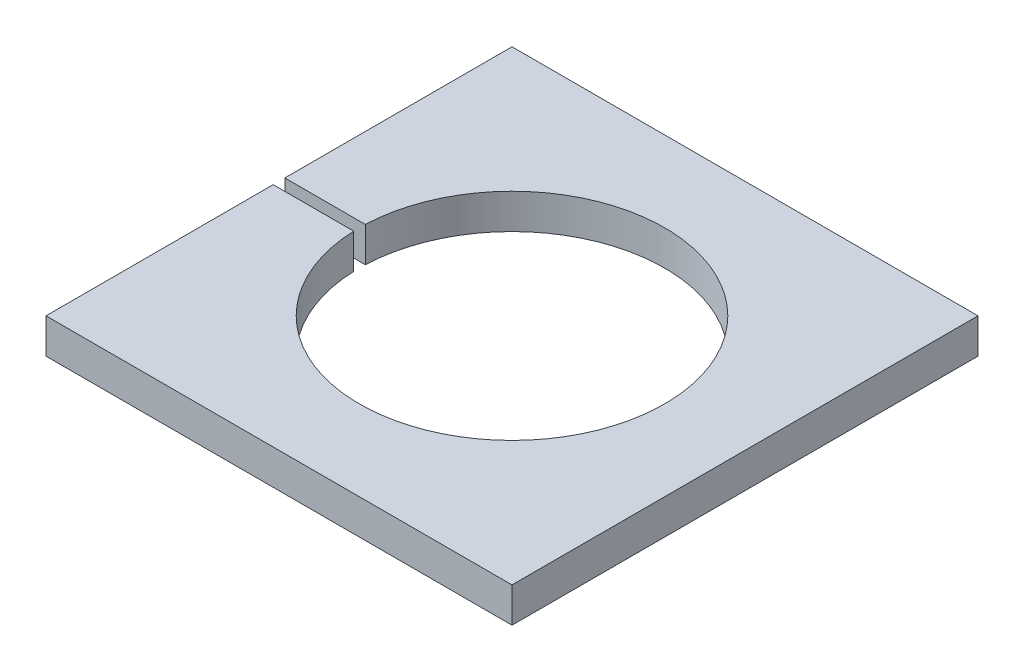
from build123d import *

# Parameters (mm, degrees)
ESQUISSE1_W                     = 80
ESQUISSE1_H                     = 80
ESQUISSE1_R                     = 26.2
EXTRUSION1_DEPTH                = 6
ESQUISSE2_W                     = 40
ESQUISSE2_H                     = 2
ENL_V_DE_MAT_EXTRU_MINCE1_DEPTH = 57.885850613


with BuildPart() as part:
    # Esquisse1 → Extrusion1 (new body)
    with BuildSketch(Plane(origin=(0, 0, 0), x_dir=(1, 0, 0), z_dir=(0, 1, 0))):
        Rectangle(ESQUISSE1_W, ESQUISSE1_H)
        with Locations(Location((0, 0, 0), (0, 0, 270))):
            Circle(ESQUISSE1_R, mode=Mode.SUBTRACT)
    extrude(amount=EXTRUSION1_DEPTH)

    # Esquisse2 → Enl_v. de mat.-Extru.-Mince1 (cut, through all)
    with BuildSketch(Plane(origin=(0, 6, 0), x_dir=(-1, 0, 0), z_dir=(0, 1, 0))):
        with Locations((20, 0)):
            Rectangle(ESQUISSE2_W, ESQUISSE2_H)
    extrude(amount=-ENL_V_DE_MAT_EXTRU_MINCE1_DEPTH, mode=Mode.SUBTRACT)


solid = part.part
